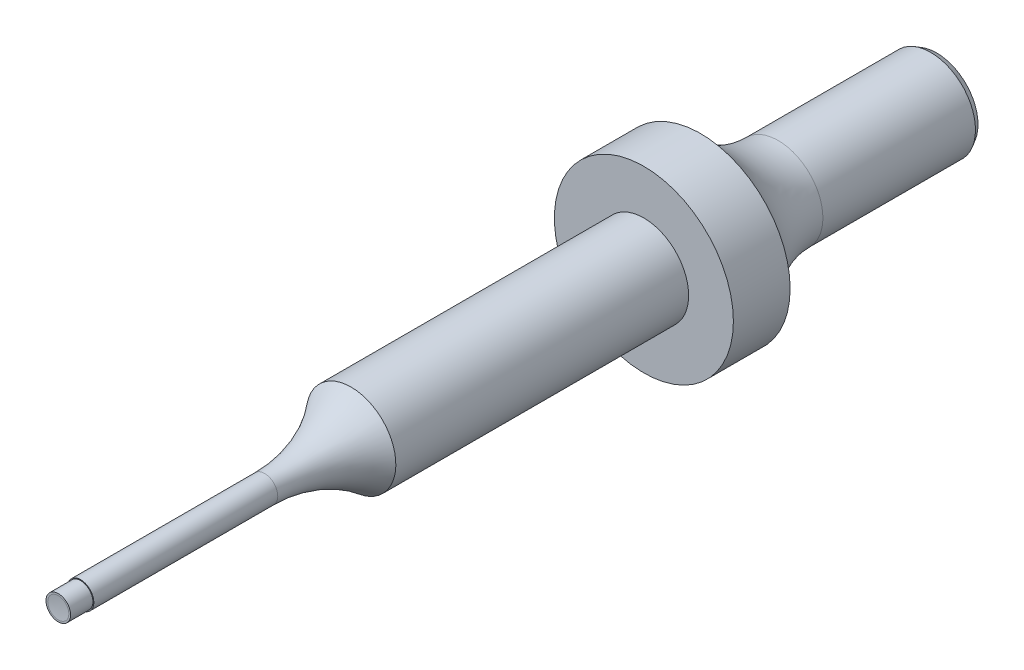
from build123d import *

# Parameters (mm, degrees)
SKETCH1_R           = 5.095
BOSS_EXTRUDE1_DEPTH = 100
SKETCH2_OUTSIDE_W   = 32.396
SKETCH2_OUTSIDE_H   = 32.396
SKETCH2_OUTSIDE_R   = 1.5
CUT_EXTRUDE1_DEPTH  = 33.333333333
SKETCH3_OUTSIDE_W   = 32.396
SKETCH3_OUTSIDE_H   = 32.396
SKETCH3_OUTSIDE_R   = 1.4
CUT_EXTRUDE2_DEPTH  = 2.5475
CHAMFER1_SIZE       = 0.679333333
CHAMFER1_SIZE2      = 0.392213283


with BuildPart() as part:
    # Sketch1 → Boss-Extrude1 (new body)
    with BuildSketch(Plane.XY):
        Circle(SKETCH1_R)
    extrude(amount=-BOSS_EXTRUDE1_DEPTH)

    # Sketch2 outside → Cut-Extrude1 (cut)
    with BuildSketch(Plane.XY):
        Rectangle(SKETCH2_OUTSIDE_W, SKETCH2_OUTSIDE_H)
        Circle(SKETCH2_OUTSIDE_R, mode=Mode.SUBTRACT)
    extrude(amount=-CUT_EXTRUDE1_DEPTH, mode=Mode.SUBTRACT)

    # Sketch3 outside → Cut-Extrude2 (cut)
    with BuildSketch(Plane.XY):
        Rectangle(SKETCH3_OUTSIDE_W, SKETCH3_OUTSIDE_H)
        Circle(SKETCH3_OUTSIDE_R, mode=Mode.SUBTRACT)
    extrude(amount=-CUT_EXTRUDE2_DEPTH, mode=Mode.SUBTRACT)

    # Sketch4 → Cut-Revolve1 (revolve, cut)
    with BuildSketch(Plane(origin=(0, 0, 0), x_dir=(0, 0, -1), z_dir=(1, 0, 0)), mode=Mode.PRIVATE) as cut_revolve1_sk:
        with BuildLine():
            Line((0, 0), (0, 1.2))
            ThreePointArc((0, 1.2), (0.053162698, 0.601046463), (0.070904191, 0))
            Line((0.070904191, 0), (0, 0))
        make_face()
    revolve(cut_revolve1_sk.sketch.rotate(Axis((0, 0, 0), (0, 0, -1)), 180), axis=Axis((0, 0, 0), (0, 0, -1)), mode=Mode.SUBTRACT)

    # Chamfer1
    chamfer1_edges = [part.edges().sort_by_distance(p)[0] for p in [
        (-5.095, 0, -100),
    ]]
    chamfer1_side = [part.faces().sort_by_distance(p)[0] for p in [
        (-5.095, 0, -66.666666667),
    ]]
    chamfer(chamfer1_edges, length=CHAMFER1_SIZE, length2=CHAMFER1_SIZE2, reference=chamfer1_side[0])

    # Sketch5 → Revolve1 (revolve)
    with BuildSketch(Plane(origin=(0, 0, 0), x_dir=(0, 0, -1), z_dir=(1, 0, 0)), mode=Mode.PRIVATE) as revolve1_sk:
        with BuildLine():
            Line((33.333333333, 0), (23.485738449, 0))
            Line((23.485738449, 0), (23.485738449, 1.5))
            ThreePointArc((23.485738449, 1.5), (28.727378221, 2.426851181), (33.333333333, 5.095))
            Line((33.333333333, 5.095), (33.333333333, 0))
        make_face()
    revolve(revolve1_sk.sketch.rotate(Axis((0, 0, -33.333333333), (0, 0, 1)), 270), axis=Axis((0, 0, -33.333333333), (0, 0, 1)))

    # Sketch6 → Revolve2 (revolve)
    with BuildSketch(Plane(origin=(0, 0, 0), x_dir=(0, 0, -1), z_dir=(1, 0, 0)), mode=Mode.PRIVATE) as revolve2_sk:
        with BuildLine():
            Line((66.666666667, 0), (81.951666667, 0))
            Line((81.951666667, 0), (81.951666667, 5.095))
            ThreePointArc((81.951666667, 5.095), (76.856666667, 6.460201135), (73.126867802, 10.19))
            Line((73.126867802, 10.19), (66.666666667, 10.19))
            Line((66.666666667, 10.19), (66.666666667, 0))
        make_face()
    revolve(revolve2_sk.sketch.rotate(Axis((0, 0, -66.666666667), (0, 0, -1)), 90), axis=Axis((0, 0, -66.666666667), (0, 0, -1)))


solid = part.part
